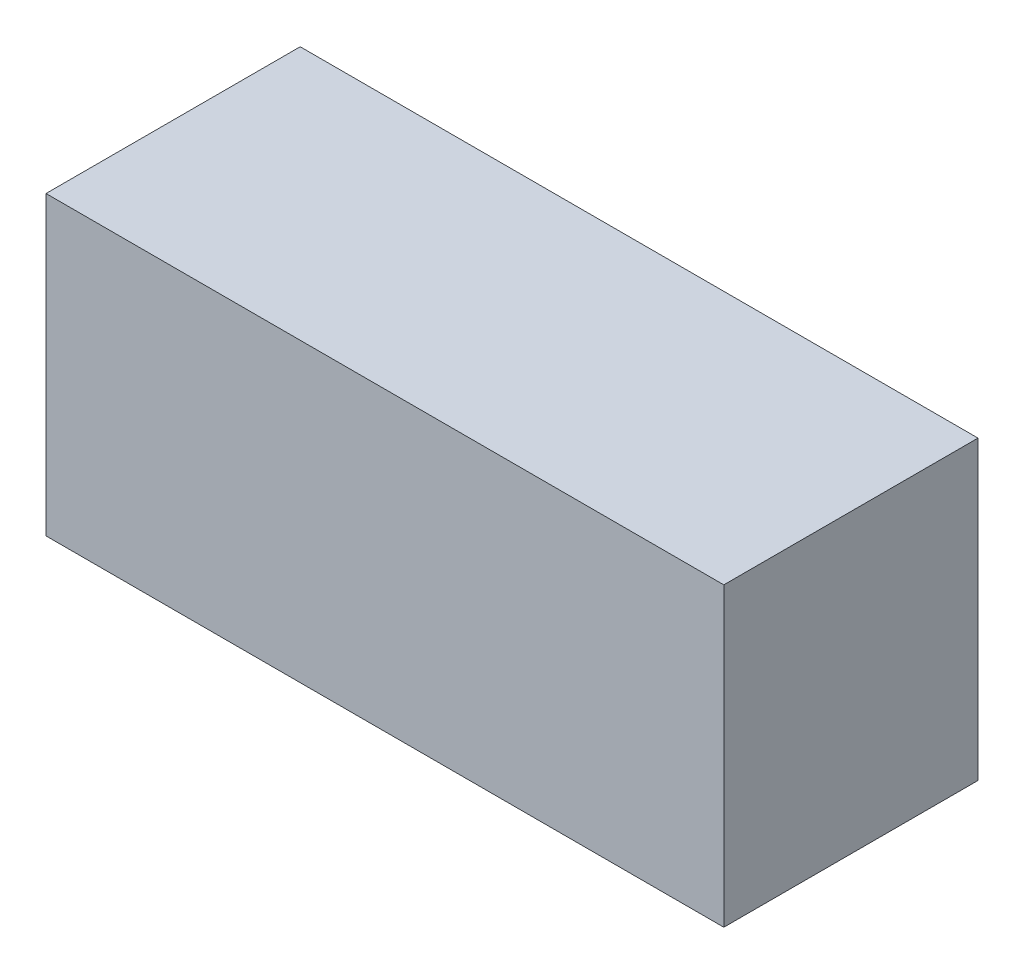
ISO-10303-21;
HEADER;
FILE_DESCRIPTION(('STEP AP214'),'2;1');
FILE_NAME('part.step','',(''),(''),'','','');
FILE_SCHEMA(('AUTOMOTIVE_DESIGN { 1 0 10303 214 1 1 1 1 }'));
ENDSEC;
DATA;
#1=APPLICATION_CONTEXT('core data for automotive mechanical design processes');
#2=APPLICATION_PROTOCOL_DEFINITION('international standard','automotive_design',2000,#1);
#3=PRODUCT_CONTEXT('',#1,'mechanical');
#4=PRODUCT('Part','Part','',(#3));
#5=PRODUCT_RELATED_PRODUCT_CATEGORY('part','',(#4));
#6=PRODUCT_DEFINITION_FORMATION('','',#4);
#7=PRODUCT_DEFINITION_CONTEXT('part definition',#1,'design');
#8=PRODUCT_DEFINITION('design','',#6,#7);
#9=PRODUCT_DEFINITION_SHAPE('','',#8);
#10=(LENGTH_UNIT() NAMED_UNIT(*) SI_UNIT(.MILLI.,.METRE.));
#11=(NAMED_UNIT(*) PLANE_ANGLE_UNIT() SI_UNIT($,.RADIAN.));
#12=(NAMED_UNIT(*) SI_UNIT($,.STERADIAN.) SOLID_ANGLE_UNIT());
#13=UNCERTAINTY_MEASURE_WITH_UNIT(LENGTH_MEASURE(1.E-05),#10,'distance_accuracy_value','');
#14=(GEOMETRIC_REPRESENTATION_CONTEXT(3) GLOBAL_UNCERTAINTY_ASSIGNED_CONTEXT((#13)) GLOBAL_UNIT_ASSIGNED_CONTEXT((#10,
#11,#12)) REPRESENTATION_CONTEXT('',''));
#15=CARTESIAN_POINT('',(0.,0.,0.));
#16=DIRECTION('',(0.,0.,1.));
#17=DIRECTION('',(1.,0.,0.));
#18=AXIS2_PLACEMENT_3D('',#15,#16,#17);
#19=CARTESIAN_POINT('',(0.,0.,15.));
#20=DIRECTION('',(1.,0.,0.));
#21=DIRECTION('',(0.,0.,-1.));
#22=AXIS2_PLACEMENT_3D('',#19,#20,#21);
#23=PLANE('',#22);
#24=DIRECTION('',(0.,-1.,0.));
#25=VECTOR('',#24,1.);
#26=CARTESIAN_POINT('',(0.,0.,-15.));
#27=LINE('',#26,#25);
#28=CARTESIAN_POINT('',(0.,35.,-15.));
#29=VERTEX_POINT('',#28);
#30=CARTESIAN_POINT('',(0.,0.,-15.));
#31=VERTEX_POINT('',#30);
#32=EDGE_CURVE('E94',#29,#31,#27,.T.);
#33=ORIENTED_EDGE('',*,*,#32,.T.);
#34=DIRECTION('',(0.,0.,-1.));
#35=VECTOR('',#34,1.);
#36=CARTESIAN_POINT('',(0.,0.,15.));
#37=LINE('',#36,#35);
#38=CARTESIAN_POINT('',(0.,0.,15.));
#39=VERTEX_POINT('',#38);
#40=EDGE_CURVE('E11',#39,#31,#37,.T.);
#41=ORIENTED_EDGE('',*,*,#40,.F.);
#42=DIRECTION('',(0.,-1.,0.));
#43=VECTOR('',#42,1.);
#44=CARTESIAN_POINT('',(0.,0.,15.));
#45=LINE('',#44,#43);
#46=CARTESIAN_POINT('',(0.,35.,15.));
#47=VERTEX_POINT('',#46);
#48=EDGE_CURVE('E82',#47,#39,#45,.T.);
#49=ORIENTED_EDGE('',*,*,#48,.F.);
#50=DIRECTION('',(0.,0.,-1.));
#51=VECTOR('',#50,1.);
#52=CARTESIAN_POINT('',(0.,35.,15.));
#53=LINE('',#52,#51);
#54=EDGE_CURVE('E90',#47,#29,#53,.T.);
#55=ORIENTED_EDGE('',*,*,#54,.T.);
#56=EDGE_LOOP('',(#33,#41,#49,#55));
#57=FACE_BOUND('',#56,.T.);
#58=ADVANCED_FACE('F31',(#57),#23,.F.);
#59=CARTESIAN_POINT('',(0.,0.,15.));
#60=DIRECTION('',(0.,1.,0.));
#61=DIRECTION('',(0.,0.,1.));
#62=AXIS2_PLACEMENT_3D('',#59,#60,#61);
#63=PLANE('',#62);
#64=DIRECTION('',(1.,0.,0.));
#65=VECTOR('',#64,1.);
#66=CARTESIAN_POINT('',(0.,0.,-15.));
#67=LINE('',#66,#65);
#68=CARTESIAN_POINT('',(80.,0.,-15.));
#69=VERTEX_POINT('',#68);
#70=EDGE_CURVE('E86',#31,#69,#67,.T.);
#71=ORIENTED_EDGE('',*,*,#70,.T.);
#72=DIRECTION('',(0.,0.,-1.));
#73=VECTOR('',#72,1.);
#74=CARTESIAN_POINT('',(80.,0.,15.));
#75=LINE('',#74,#73);
#76=CARTESIAN_POINT('',(80.,0.,15.));
#77=VERTEX_POINT('',#76);
#78=EDGE_CURVE('E39',#77,#69,#75,.T.);
#79=ORIENTED_EDGE('',*,*,#78,.F.);
#80=DIRECTION('',(1.,0.,0.));
#81=VECTOR('',#80,1.);
#82=CARTESIAN_POINT('',(0.,0.,15.));
#83=LINE('',#82,#81);
#84=EDGE_CURVE('E77',#39,#77,#83,.T.);
#85=ORIENTED_EDGE('',*,*,#84,.F.);
#86=ORIENTED_EDGE('',*,*,#40,.T.);
#87=EDGE_LOOP('',(#71,#79,#85,#86));
#88=FACE_BOUND('',#87,.T.);
#89=ADVANCED_FACE('F85',(#88),#63,.F.);
#90=CARTESIAN_POINT('',(80.,0.,15.));
#91=DIRECTION('',(-1.,0.,0.));
#92=DIRECTION('',(0.,0.,1.));
#93=AXIS2_PLACEMENT_3D('',#90,#91,#92);
#94=PLANE('',#93);
#95=DIRECTION('',(0.,1.,0.));
#96=VECTOR('',#95,1.);
#97=CARTESIAN_POINT('',(80.,0.,-15.));
#98=LINE('',#97,#96);
#99=CARTESIAN_POINT('',(80.,35.,-15.));
#100=VERTEX_POINT('',#99);
#101=EDGE_CURVE('E64',#69,#100,#98,.T.);
#102=ORIENTED_EDGE('',*,*,#101,.T.);
#103=DIRECTION('',(0.,0.,-1.));
#104=VECTOR('',#103,1.);
#105=CARTESIAN_POINT('',(80.,35.,15.));
#106=LINE('',#105,#104);
#107=CARTESIAN_POINT('',(80.,35.,15.));
#108=VERTEX_POINT('',#107);
#109=EDGE_CURVE('E87',#108,#100,#106,.T.);
#110=ORIENTED_EDGE('',*,*,#109,.F.);
#111=DIRECTION('',(0.,1.,0.));
#112=VECTOR('',#111,1.);
#113=CARTESIAN_POINT('',(80.,0.,15.));
#114=LINE('',#113,#112);
#115=EDGE_CURVE('E80',#77,#108,#114,.T.);
#116=ORIENTED_EDGE('',*,*,#115,.F.);
#117=ORIENTED_EDGE('',*,*,#78,.T.);
#118=EDGE_LOOP('',(#102,#110,#116,#117));
#119=FACE_BOUND('',#118,.T.);
#120=ADVANCED_FACE('F88',(#119),#94,.F.);
#121=CARTESIAN_POINT('',(0.,35.,15.));
#122=DIRECTION('',(0.,-1.,0.));
#123=DIRECTION('',(0.,0.,-1.));
#124=AXIS2_PLACEMENT_3D('',#121,#122,#123);
#125=PLANE('',#124);
#126=DIRECTION('',(-1.,0.,0.));
#127=VECTOR('',#126,1.);
#128=CARTESIAN_POINT('',(0.,35.,-15.));
#129=LINE('',#128,#127);
#130=EDGE_CURVE('E70',#100,#29,#129,.T.);
#131=ORIENTED_EDGE('',*,*,#130,.T.);
#132=ORIENTED_EDGE('',*,*,#54,.F.);
#133=DIRECTION('',(-1.,0.,0.));
#134=VECTOR('',#133,1.);
#135=CARTESIAN_POINT('',(0.,35.,15.));
#136=LINE('',#135,#134);
#137=EDGE_CURVE('E47',#108,#47,#136,.T.);
#138=ORIENTED_EDGE('',*,*,#137,.F.);
#139=ORIENTED_EDGE('',*,*,#109,.T.);
#140=EDGE_LOOP('',(#131,#132,#138,#139));
#141=FACE_BOUND('',#140,.T.);
#142=ADVANCED_FACE('F101',(#141),#125,.F.);
#143=CARTESIAN_POINT('',(0.,35.,15.));
#144=DIRECTION('',(0.,0.,-1.));
#145=DIRECTION('',(-1.,0.,0.));
#146=AXIS2_PLACEMENT_3D('',#143,#144,#145);
#147=PLANE('',#146);
#148=ORIENTED_EDGE('',*,*,#48,.T.);
#149=ORIENTED_EDGE('',*,*,#84,.T.);
#150=ORIENTED_EDGE('',*,*,#115,.T.);
#151=ORIENTED_EDGE('',*,*,#137,.T.);
#152=EDGE_LOOP('',(#148,#149,#150,#151));
#153=FACE_BOUND('',#152,.T.);
#154=ADVANCED_FACE('F78',(#153),#147,.F.);
#155=CARTESIAN_POINT('',(0.,35.,-15.));
#156=DIRECTION('',(0.,0.,-1.));
#157=DIRECTION('',(-1.,0.,0.));
#158=AXIS2_PLACEMENT_3D('',#155,#156,#157);
#159=PLANE('',#158);
#160=ORIENTED_EDGE('',*,*,#32,.F.);
#161=ORIENTED_EDGE('',*,*,#130,.F.);
#162=ORIENTED_EDGE('',*,*,#101,.F.);
#163=ORIENTED_EDGE('',*,*,#70,.F.);
#164=EDGE_LOOP('',(#160,#161,#162,#163));
#165=FACE_BOUND('',#164,.T.);
#166=ADVANCED_FACE('F104',(#165),#159,.T.);
#167=CLOSED_SHELL('',(#58,#89,#120,#142,#154,#166));
#168=MANIFOLD_SOLID_BREP('B2',#167);
#169=ADVANCED_BREP_SHAPE_REPRESENTATION('',(#18,#168),#14);
#170=SHAPE_DEFINITION_REPRESENTATION(#9,#169);
ENDSEC;
END-ISO-10303-21;
